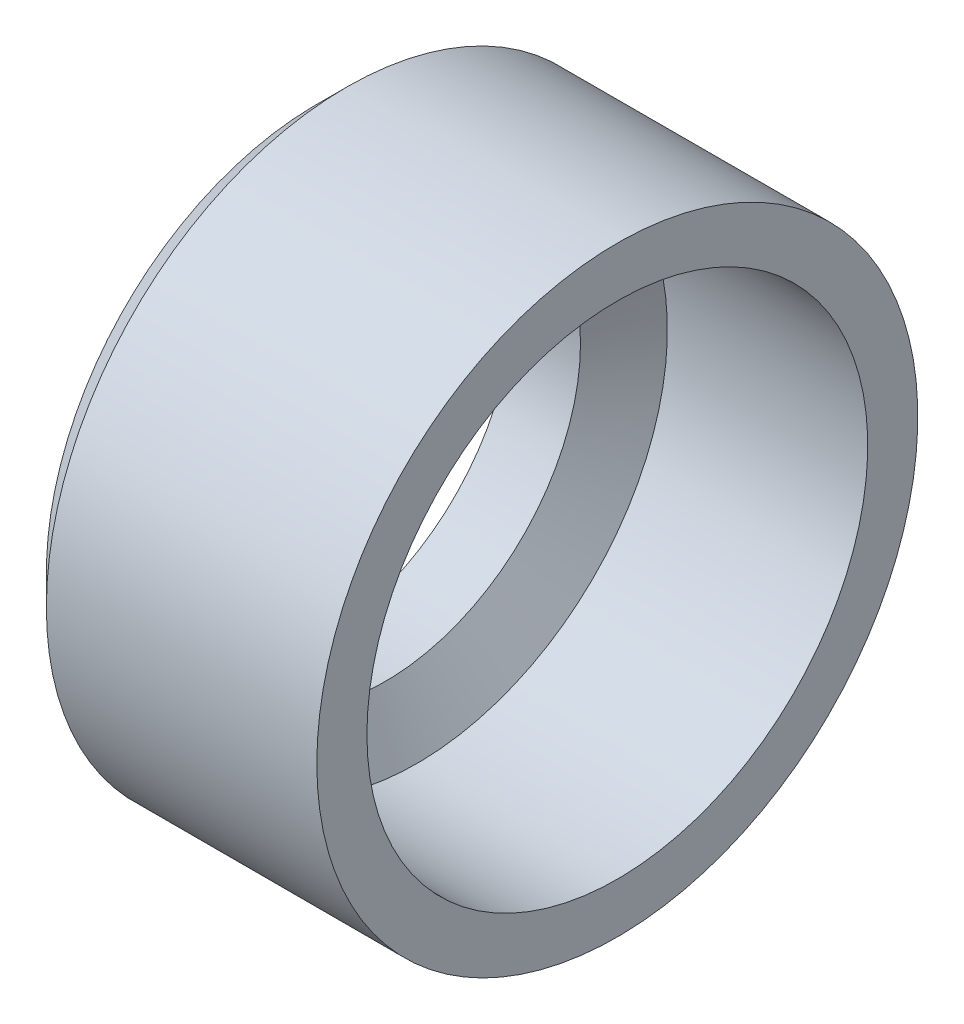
from build123d import *

# Parameters (mm, degrees)
FASE1_SIZE = 0.3


with BuildPart() as part:
    # Skizze1 → Rotation1 (revolve)
    with BuildSketch(Plane.XY, mode=Mode.PRIVATE) as rotation1_sk:
        Polygon((0, 1.95), (0.682457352, 1.95), (1, 2.5), (3, 2.5), (3, 3), (0, 3), align=None)
    revolve(rotation1_sk.sketch.rotate(Axis((0, 0, 0), (1, 0, 0)), 90), axis=Axis((0, 0, 0), (1, 0, 0)))

    # Fase1
    fase1_edges = [part.edges().sort_by_distance(p)[0] for p in [
        (0, 0, -3),
    ]]
    chamfer(fase1_edges, length=FASE1_SIZE)


solid = part.part
